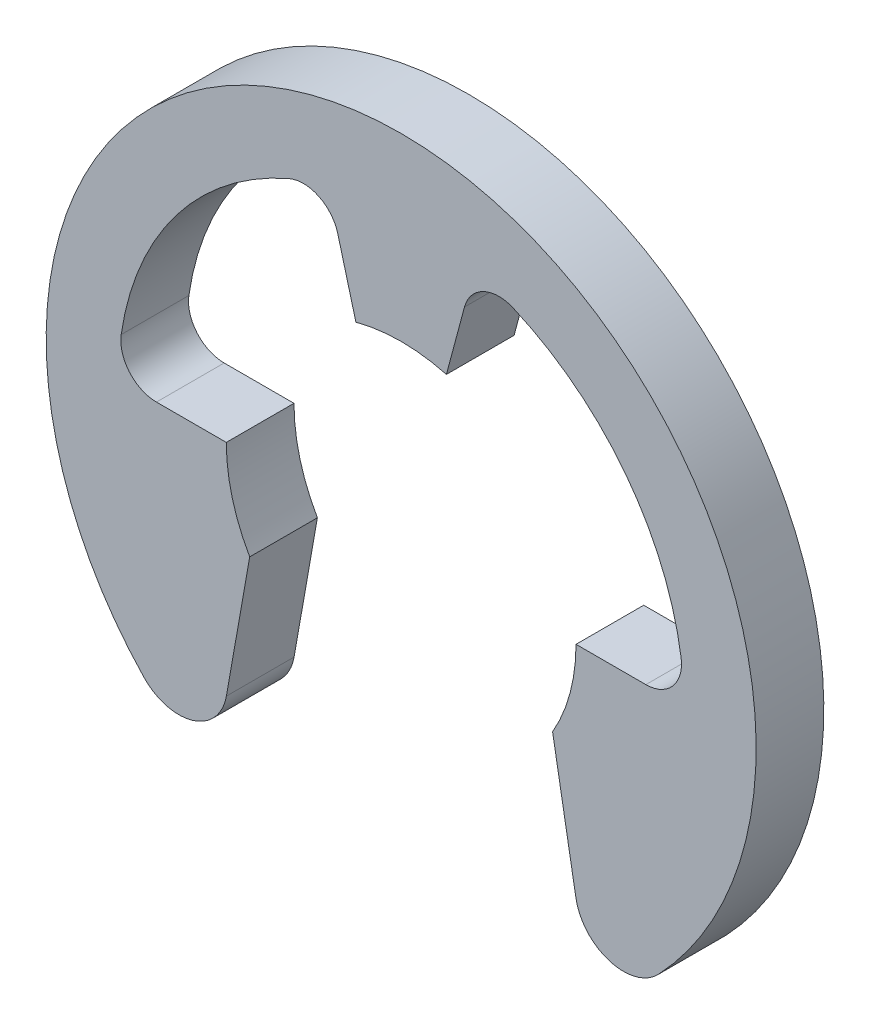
from build123d import *

# Parameters (mm, degrees)
BODY_DEPTH = 0.6


with BuildPart() as part:
    # BodySke → Body (new body)
    with BuildSketch(Plane.XY):
        with BuildLine():
            Line((1.342339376, -0.775), (1.549061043, -1.94737683))
            ThreePointArc((1.549061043, -1.94737683), (1.846938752, -2.282734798), (2.280530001, -2.167866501))
            ThreePointArc((2.280530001, -2.167866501), (0, 3.1465), (-2.280530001, -2.167866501))
            ThreePointArc((-2.280530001, -2.167866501), (-1.846938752, -2.282734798), (-1.549061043, -1.94737683))
            Line((-1.549061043, -1.94737683), (-1.342339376, -0.775))
            ThreePointArc((-1.342339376, -0.775), (-1.497185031, -0.40116952), (-1.55, 0))
            Line((-1.55, 0), (-2.168878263, 0))
            ThreePointArc((-2.168878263, 0), (-2.407975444, 0.10933134), (-2.48168043, 0.361696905))
            ThreePointArc((-2.48168043, 0.361696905), (-1.989650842, 1.526712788), (-0.991678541, 2.303505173))
            ThreePointArc((-0.991678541, 2.303505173), (-0.72883587, 2.297628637), (-0.561347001, 2.094975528))
            Line((-0.561347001, 2.094975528), (-0.40116952, 1.497185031))
            ThreePointArc((-0.40116952, 1.497185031), (0, 1.55), (0.40116952, 1.497185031))
            Line((0.40116952, 1.497185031), (0.561347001, 2.094975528))
            ThreePointArc((0.561347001, 2.094975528), (0.72883587, 2.297628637), (0.991678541, 2.303505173))
            ThreePointArc((0.991678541, 2.303505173), (1.989650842, 1.526712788), (2.48168043, 0.361696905))
            ThreePointArc((2.48168043, 0.361696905), (2.407975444, 0.10933134), (2.168878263, 0))
            Line((2.168878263, 0), (1.55, 0))
            ThreePointArc((1.55, 0), (1.497185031, -0.40116952), (1.342339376, -0.775))
        make_face()
    extrude(amount=-BODY_DEPTH)


solid = part.part
